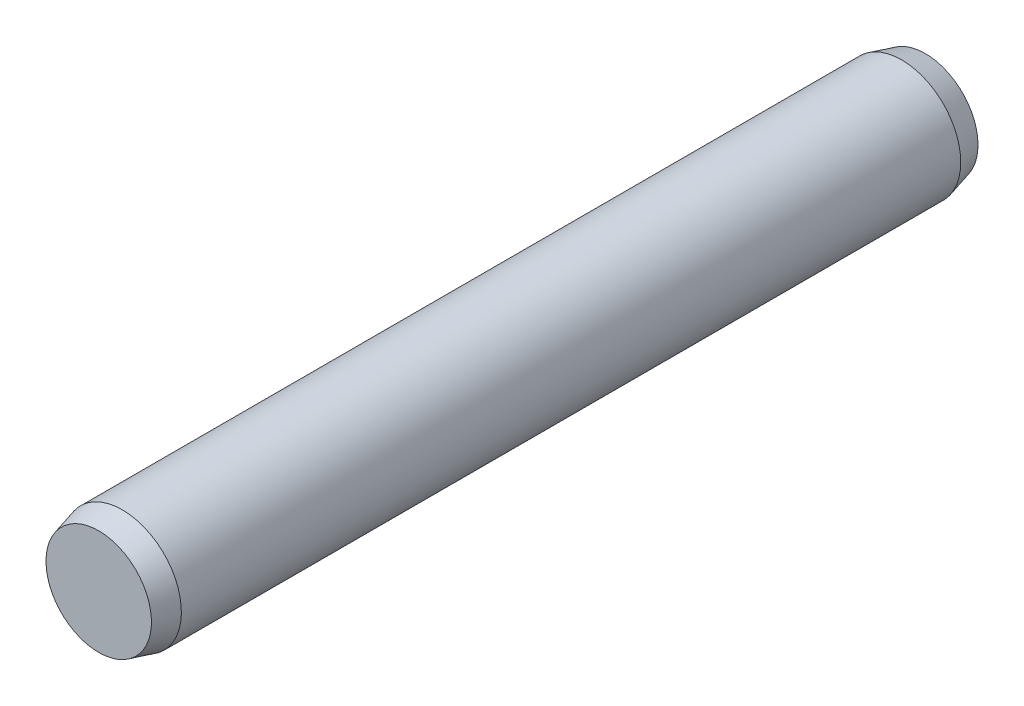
ISO-10303-21;
HEADER;
FILE_DESCRIPTION(('STEP AP214'),'2;1');
FILE_NAME('part.step','',(''),(''),'','','');
FILE_SCHEMA(('AUTOMOTIVE_DESIGN { 1 0 10303 214 1 1 1 1 }'));
ENDSEC;
DATA;
#1=APPLICATION_CONTEXT('core data for automotive mechanical design processes');
#2=APPLICATION_PROTOCOL_DEFINITION('international standard','automotive_design',2000,#1);
#3=PRODUCT_CONTEXT('',#1,'mechanical');
#4=PRODUCT('Part','Part','',(#3));
#5=PRODUCT_RELATED_PRODUCT_CATEGORY('part','',(#4));
#6=PRODUCT_DEFINITION_FORMATION('','',#4);
#7=PRODUCT_DEFINITION_CONTEXT('part definition',#1,'design');
#8=PRODUCT_DEFINITION('design','',#6,#7);
#9=PRODUCT_DEFINITION_SHAPE('','',#8);
#10=(LENGTH_UNIT() NAMED_UNIT(*) SI_UNIT(.MILLI.,.METRE.));
#11=(NAMED_UNIT(*) PLANE_ANGLE_UNIT() SI_UNIT($,.RADIAN.));
#12=(NAMED_UNIT(*) SI_UNIT($,.STERADIAN.) SOLID_ANGLE_UNIT());
#13=UNCERTAINTY_MEASURE_WITH_UNIT(LENGTH_MEASURE(1.E-05),#10,'distance_accuracy_value','');
#14=(GEOMETRIC_REPRESENTATION_CONTEXT(3) GLOBAL_UNCERTAINTY_ASSIGNED_CONTEXT((#13)) GLOBAL_UNIT_ASSIGNED_CONTEXT((#10,
#11,#12)) REPRESENTATION_CONTEXT('',''));
#15=CARTESIAN_POINT('',(0.,0.,0.));
#16=DIRECTION('',(0.,0.,1.));
#17=DIRECTION('',(1.,0.,0.));
#18=AXIS2_PLACEMENT_3D('',#15,#16,#17);
#19=CARTESIAN_POINT('',(0.,0.,3.50000000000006));
#20=DIRECTION('',(0.,0.,-1.));
#21=DIRECTION('',(0.,1.,0.));
#22=AXIS2_PLACEMENT_3D('',#19,#20,#21);
#23=PLANE('',#22);
#24=CARTESIAN_POINT('',(0.,0.,3.50000000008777));
#25=DIRECTION('',(0.,0.,-1.));
#26=DIRECTION('',(-1.,0.,0.));
#27=AXIS2_PLACEMENT_3D('',#24,#25,#26);
#28=CIRCLE('',#27,0.446410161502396);
#29=CARTESIAN_POINT('',(-0.446410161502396,0.,3.50000000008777));
#30=VERTEX_POINT('',#29);
#31=EDGE_CURVE('E17',#30,#30,#28,.T.);
#32=ORIENTED_EDGE('',*,*,#31,.F.);
#33=EDGE_LOOP('',(#32));
#34=FACE_BOUND('',#33,.T.);
#35=ADVANCED_FACE('F14',(#34),#23,.F.);
#36=CARTESIAN_POINT('',(0.,0.,-3.49999999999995));
#37=DIRECTION('',(0.,0.,-1.));
#38=DIRECTION('',(0.,1.,0.));
#39=AXIS2_PLACEMENT_3D('',#36,#37,#38);
#40=PLANE('',#39);
#41=CARTESIAN_POINT('',(-2.22218077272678E-13,0.,-3.50000000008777));
#42=DIRECTION('',(0.,0.,1.));
#43=DIRECTION('',(1.,0.,0.));
#44=AXIS2_PLACEMENT_3D('',#41,#42,#43);
#45=CIRCLE('',#44,0.446410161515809);
#46=CARTESIAN_POINT('',(0.446410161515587,0.,-3.50000000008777));
#47=VERTEX_POINT('',#46);
#48=EDGE_CURVE('E26',#47,#47,#45,.T.);
#49=ORIENTED_EDGE('',*,*,#48,.F.);
#50=EDGE_LOOP('',(#49));
#51=FACE_BOUND('',#50,.T.);
#52=ADVANCED_FACE('F37',(#51),#40,.T.);
#53=CARTESIAN_POINT('',(0.,0.,3.30000000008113));
#54=DIRECTION('',(0.,0.,-1.));
#55=DIRECTION('',(-1.,0.,0.));
#56=AXIS2_PLACEMENT_3D('',#53,#54,#55);
#57=CONICAL_SURFACE('',#56,0.499999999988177,0.261799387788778);
#58=CARTESIAN_POINT('',(-1.11022302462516E-13,0.,3.30000000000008));
#59=DIRECTION('',(0.,0.,-1.));
#60=DIRECTION('',(0.,1.,0.));
#61=AXIS2_PLACEMENT_3D('',#58,#59,#60);
#62=CIRCLE('',#61,0.5);
#63=CARTESIAN_POINT('',(-1.11022302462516E-13,0.5,3.30000000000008));
#64=VERTEX_POINT('',#63);
#65=EDGE_CURVE('E21',#64,#64,#62,.T.);
#66=ORIENTED_EDGE('',*,*,#65,.F.);
#67=EDGE_LOOP('',(#66));
#68=FACE_BOUND('',#67,.T.);
#69=ORIENTED_EDGE('',*,*,#31,.T.);
#70=EDGE_LOOP('',(#69));
#71=FACE_BOUND('',#70,.T.);
#72=ADVANCED_FACE('F34',(#68,#71),#57,.T.);
#73=CARTESIAN_POINT('',(-2.22044604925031E-13,0.,-3.30000000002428));
#74=DIRECTION('',(0.,0.,1.));
#75=DIRECTION('',(1.,0.,0.));
#76=AXIS2_PLACEMENT_3D('',#73,#74,#75);
#77=CONICAL_SURFACE('',#76,0.50000000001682,0.261799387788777);
#78=CARTESIAN_POINT('',(-1.11022302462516E-13,0.,-3.30000000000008));
#79=DIRECTION('',(0.,0.,-1.));
#80=DIRECTION('',(0.,1.,0.));
#81=AXIS2_PLACEMENT_3D('',#78,#79,#80);
#82=CIRCLE('',#81,0.5);
#83=CARTESIAN_POINT('',(-1.11022302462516E-13,0.5,-3.30000000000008));
#84=VERTEX_POINT('',#83);
#85=EDGE_CURVE('E10',#84,#84,#82,.F.);
#86=ORIENTED_EDGE('',*,*,#85,.F.);
#87=EDGE_LOOP('',(#86));
#88=FACE_BOUND('',#87,.T.);
#89=ORIENTED_EDGE('',*,*,#48,.T.);
#90=EDGE_LOOP('',(#89));
#91=FACE_BOUND('',#90,.T.);
#92=ADVANCED_FACE('F45',(#88,#91),#77,.T.);
#93=CARTESIAN_POINT('',(-1.11022302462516E-13,0.,3.84999999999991));
#94=DIRECTION('',(0.,0.,-1.));
#95=DIRECTION('',(0.,1.,0.));
#96=AXIS2_PLACEMENT_3D('',#93,#94,#95);
#97=CYLINDRICAL_SURFACE('',#96,0.5);
#98=ORIENTED_EDGE('',*,*,#85,.T.);
#99=EDGE_LOOP('',(#98));
#100=FACE_BOUND('',#99,.T.);
#101=ORIENTED_EDGE('',*,*,#65,.T.);
#102=EDGE_LOOP('',(#101));
#103=FACE_BOUND('',#102,.T.);
#104=ADVANCED_FACE('F43',(#100,#103),#97,.T.);
#105=CLOSED_SHELL('',(#35,#52,#72,#92,#104));
#106=MANIFOLD_SOLID_BREP('B1',#105);
#107=ADVANCED_BREP_SHAPE_REPRESENTATION('',(#18,#106),#14);
#108=SHAPE_DEFINITION_REPRESENTATION(#9,#107);
ENDSEC;
END-ISO-10303-21;
